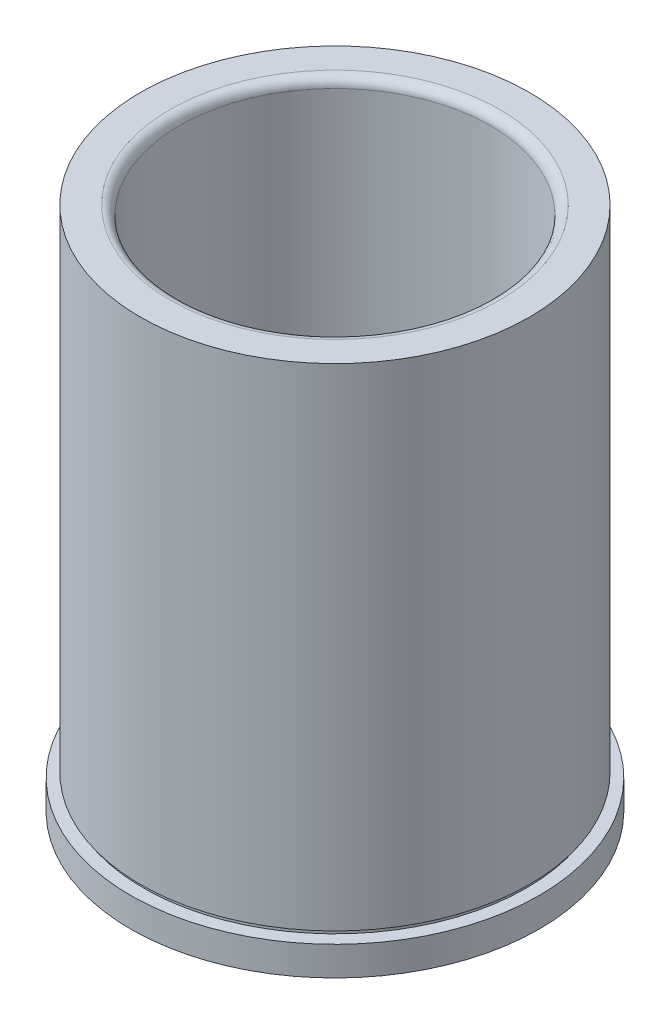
ISO-10303-21;
HEADER;
FILE_DESCRIPTION(('STEP AP214'),'2;1');
FILE_NAME('part.step','',(''),(''),'','','');
FILE_SCHEMA(('AUTOMOTIVE_DESIGN { 1 0 10303 214 1 1 1 1 }'));
ENDSEC;
DATA;
#1=APPLICATION_CONTEXT('core data for automotive mechanical design processes');
#2=APPLICATION_PROTOCOL_DEFINITION('international standard','automotive_design',2000,#1);
#3=PRODUCT_CONTEXT('',#1,'mechanical');
#4=PRODUCT('Part','Part','',(#3));
#5=PRODUCT_RELATED_PRODUCT_CATEGORY('part','',(#4));
#6=PRODUCT_DEFINITION_FORMATION('','',#4);
#7=PRODUCT_DEFINITION_CONTEXT('part definition',#1,'design');
#8=PRODUCT_DEFINITION('design','',#6,#7);
#9=PRODUCT_DEFINITION_SHAPE('','',#8);
#10=(LENGTH_UNIT() NAMED_UNIT(*) SI_UNIT(.MILLI.,.METRE.));
#11=(NAMED_UNIT(*) PLANE_ANGLE_UNIT() SI_UNIT($,.RADIAN.));
#12=(NAMED_UNIT(*) SI_UNIT($,.STERADIAN.) SOLID_ANGLE_UNIT());
#13=UNCERTAINTY_MEASURE_WITH_UNIT(LENGTH_MEASURE(1.E-05),#10,'distance_accuracy_value','');
#14=(GEOMETRIC_REPRESENTATION_CONTEXT(3) GLOBAL_UNCERTAINTY_ASSIGNED_CONTEXT((#13)) GLOBAL_UNIT_ASSIGNED_CONTEXT((#10,
#11,#12)) REPRESENTATION_CONTEXT('',''));
#15=CARTESIAN_POINT('',(0.,0.,0.));
#16=DIRECTION('',(0.,0.,1.));
#17=DIRECTION('',(1.,0.,0.));
#18=AXIS2_PLACEMENT_3D('',#15,#16,#17);
#19=CARTESIAN_POINT('',(-31.75635,101.650690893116,0.));
#20=DIRECTION('',(0.,-1.,0.));
#21=DIRECTION('',(1.,0.,0.));
#22=AXIS2_PLACEMENT_3D('',#19,#20,#21);
#23=PLANE('',#22);
#24=CARTESIAN_POINT('',(-3.54911695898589E-13,101.650690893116,0.));
#25=DIRECTION('',(0.,-1.,0.));
#26=DIRECTION('',(1.,0.,0.));
#27=AXIS2_PLACEMENT_3D('',#24,#25,#26);
#28=CIRCLE('',#27,26.9303499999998);
#29=CARTESIAN_POINT('',(26.9303499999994,101.650690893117,0.));
#30=VERTEX_POINT('',#29);
#31=EDGE_CURVE('E35',#30,#30,#28,.T.);
#32=ORIENTED_EDGE('',*,*,#31,.T.);
#33=EDGE_LOOP('',(#32));
#34=FACE_BOUND('',#33,.T.);
#35=CARTESIAN_POINT('',(-3.54911695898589E-13,101.650690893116,0.));
#36=DIRECTION('',(0.,-1.,0.));
#37=DIRECTION('',(1.,0.,0.));
#38=AXIS2_PLACEMENT_3D('',#35,#36,#37);
#39=CIRCLE('',#38,31.7563499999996);
#40=CARTESIAN_POINT('',(31.7563499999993,101.650690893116,0.));
#41=VERTEX_POINT('',#40);
#42=EDGE_CURVE('E63',#41,#41,#39,.T.);
#43=ORIENTED_EDGE('',*,*,#42,.F.);
#44=EDGE_LOOP('',(#43));
#45=FACE_BOUND('',#44,.T.);
#46=ADVANCED_FACE('F28',(#34,#45),#23,.F.);
#47=CARTESIAN_POINT('',(3.49148336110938E-12,-1000.,0.));
#48=DIRECTION('',(0.,-1.,0.));
#49=DIRECTION('',(1.,0.,0.));
#50=AXIS2_PLACEMENT_3D('',#47,#48,#49);
#51=CYLINDRICAL_SURFACE('',#50,25.4063499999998);
#52=CARTESIAN_POINT('',(-3.49590675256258E-13,100.126690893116,0.));
#53=DIRECTION('',(0.,-1.,0.));
#54=DIRECTION('',(1.,0.,0.));
#55=AXIS2_PLACEMENT_3D('',#52,#53,#54);
#56=CIRCLE('',#55,25.4063499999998);
#57=CARTESIAN_POINT('',(25.4063499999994,100.126690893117,0.));
#58=VERTEX_POINT('',#57);
#59=EDGE_CURVE('E10',#58,#58,#56,.F.);
#60=ORIENTED_EDGE('',*,*,#59,.T.);
#61=EDGE_LOOP('',(#60));
#62=FACE_BOUND('',#61,.T.);
#63=CARTESIAN_POINT('',(0.,16.7417464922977,0.));
#64=DIRECTION('',(0.,-1.,0.));
#65=DIRECTION('',(1.,0.,0.));
#66=AXIS2_PLACEMENT_3D('',#63,#64,#65);
#67=CIRCLE('',#66,25.4063499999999);
#68=CARTESIAN_POINT('',(25.4063499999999,16.7417464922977,0.));
#69=VERTEX_POINT('',#68);
#70=EDGE_CURVE('E39',#69,#69,#67,.T.);
#71=ORIENTED_EDGE('',*,*,#70,.T.);
#72=EDGE_LOOP('',(#71));
#73=FACE_BOUND('',#72,.T.);
#74=ADVANCED_FACE('F70',(#62,#73),#51,.F.);
#75=CARTESIAN_POINT('',(0.,15.9256908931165,0.));
#76=DIRECTION('',(0.,-1.,0.));
#77=DIRECTION('',(1.,0.,0.));
#78=AXIS2_PLACEMENT_3D('',#75,#76,#77);
#79=CONICAL_SURFACE('',#78,26.2224055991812,0.78539816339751);
#80=ORIENTED_EDGE('',*,*,#70,.F.);
#81=EDGE_LOOP('',(#80));
#82=FACE_BOUND('',#81,.T.);
#83=CARTESIAN_POINT('',(0.,15.9256908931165,0.));
#84=DIRECTION('',(0.,-1.,0.));
#85=DIRECTION('',(1.,0.,0.));
#86=AXIS2_PLACEMENT_3D('',#83,#84,#85);
#87=CIRCLE('',#86,26.2224055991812);
#88=CARTESIAN_POINT('',(26.2224055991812,15.9256908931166,0.));
#89=VERTEX_POINT('',#88);
#90=EDGE_CURVE('E43',#89,#89,#87,.T.);
#91=ORIENTED_EDGE('',*,*,#90,.T.);
#92=EDGE_LOOP('',(#91));
#93=FACE_BOUND('',#92,.T.);
#94=ADVANCED_FACE('F74',(#82,#93),#79,.F.);
#95=CARTESIAN_POINT('',(-26.2224055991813,15.9256908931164,0.));
#96=DIRECTION('',(0.,1.,0.));
#97=DIRECTION('',(-1.,0.,0.));
#98=AXIS2_PLACEMENT_3D('',#95,#96,#97);
#99=PLANE('',#98);
#100=ORIENTED_EDGE('',*,*,#90,.F.);
#101=EDGE_LOOP('',(#100));
#102=FACE_BOUND('',#101,.T.);
#103=CARTESIAN_POINT('',(0.,15.9256908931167,0.));
#104=DIRECTION('',(0.,-1.,0.));
#105=DIRECTION('',(1.,0.,0.));
#106=AXIS2_PLACEMENT_3D('',#103,#104,#105);
#107=CIRCLE('',#106,33.3374999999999);
#108=CARTESIAN_POINT('',(33.3374999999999,15.9256908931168,0.));
#109=VERTEX_POINT('',#108);
#110=EDGE_CURVE('E48',#109,#109,#107,.T.);
#111=ORIENTED_EDGE('',*,*,#110,.T.);
#112=EDGE_LOOP('',(#111));
#113=FACE_BOUND('',#112,.T.);
#114=ADVANCED_FACE('F79',(#102,#113),#99,.F.);
#115=CARTESIAN_POINT('',(3.49148336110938E-12,-1000.,0.));
#116=DIRECTION('',(0.,-1.,0.));
#117=DIRECTION('',(1.,0.,0.));
#118=AXIS2_PLACEMENT_3D('',#115,#116,#117);
#119=CYLINDRICAL_SURFACE('',#118,33.3374999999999);
#120=ORIENTED_EDGE('',*,*,#110,.F.);
#121=EDGE_LOOP('',(#120));
#122=FACE_BOUND('',#121,.T.);
#123=CARTESIAN_POINT('',(0.,20.6881908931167,0.));
#124=DIRECTION('',(0.,-1.,0.));
#125=DIRECTION('',(1.,0.,0.));
#126=AXIS2_PLACEMENT_3D('',#123,#124,#125);
#127=CIRCLE('',#126,33.3374999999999);
#128=CARTESIAN_POINT('',(33.3374999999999,20.6881908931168,0.));
#129=VERTEX_POINT('',#128);
#130=EDGE_CURVE('E51',#129,#129,#127,.T.);
#131=ORIENTED_EDGE('',*,*,#130,.T.);
#132=EDGE_LOOP('',(#131));
#133=FACE_BOUND('',#132,.T.);
#134=ADVANCED_FACE('F83',(#122,#133),#119,.T.);
#135=CARTESIAN_POINT('',(-33.3375,20.6881908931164,0.));
#136=DIRECTION('',(0.,-1.,0.));
#137=DIRECTION('',(1.,0.,0.));
#138=AXIS2_PLACEMENT_3D('',#135,#136,#137);
#139=PLANE('',#138);
#140=ORIENTED_EDGE('',*,*,#130,.F.);
#141=EDGE_LOOP('',(#140));
#142=FACE_BOUND('',#141,.T.);
#143=CARTESIAN_POINT('',(0.,20.6881908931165,0.));
#144=DIRECTION('',(0.,-1.,0.));
#145=DIRECTION('',(1.,0.,0.));
#146=AXIS2_PLACEMENT_3D('',#143,#144,#145);
#147=CIRCLE('',#146,31.2483499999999);
#148=CARTESIAN_POINT('',(31.2483499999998,20.6881908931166,0.));
#149=VERTEX_POINT('',#148);
#150=EDGE_CURVE('E54',#149,#149,#147,.T.);
#151=ORIENTED_EDGE('',*,*,#150,.T.);
#152=EDGE_LOOP('',(#151));
#153=FACE_BOUND('',#152,.T.);
#154=ADVANCED_FACE('F87',(#142,#153),#139,.F.);
#155=CARTESIAN_POINT('',(3.49148336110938E-12,-1000.,0.));
#156=DIRECTION('',(0.,-1.,0.));
#157=DIRECTION('',(1.,0.,0.));
#158=AXIS2_PLACEMENT_3D('',#155,#156,#157);
#159=CYLINDRICAL_SURFACE('',#158,31.2483499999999);
#160=ORIENTED_EDGE('',*,*,#150,.F.);
#161=EDGE_LOOP('',(#160));
#162=FACE_BOUND('',#161,.T.);
#163=CARTESIAN_POINT('',(0.,21.4501908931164,0.));
#164=DIRECTION('',(0.,-1.,0.));
#165=DIRECTION('',(1.,0.,0.));
#166=AXIS2_PLACEMENT_3D('',#163,#164,#165);
#167=CIRCLE('',#166,31.2483499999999);
#168=CARTESIAN_POINT('',(31.2483499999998,21.4501908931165,0.));
#169=VERTEX_POINT('',#168);
#170=EDGE_CURVE('E57',#169,#169,#167,.T.);
#171=ORIENTED_EDGE('',*,*,#170,.T.);
#172=EDGE_LOOP('',(#171));
#173=FACE_BOUND('',#172,.T.);
#174=ADVANCED_FACE('F91',(#162,#173),#159,.T.);
#175=CARTESIAN_POINT('',(-31.75635,21.4501908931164,0.));
#176=DIRECTION('',(0.,1.,0.));
#177=DIRECTION('',(-1.,0.,0.));
#178=AXIS2_PLACEMENT_3D('',#175,#176,#177);
#179=PLANE('',#178);
#180=ORIENTED_EDGE('',*,*,#170,.F.);
#181=EDGE_LOOP('',(#180));
#182=FACE_BOUND('',#181,.T.);
#183=CARTESIAN_POINT('',(0.,21.4501908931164,0.));
#184=DIRECTION('',(0.,-1.,0.));
#185=DIRECTION('',(1.,0.,0.));
#186=AXIS2_PLACEMENT_3D('',#183,#184,#185);
#187=CIRCLE('',#186,31.7563499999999);
#188=CARTESIAN_POINT('',(31.7563499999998,21.4501908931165,0.));
#189=VERTEX_POINT('',#188);
#190=EDGE_CURVE('E60',#189,#189,#187,.T.);
#191=ORIENTED_EDGE('',*,*,#190,.T.);
#192=EDGE_LOOP('',(#191));
#193=FACE_BOUND('',#192,.T.);
#194=ADVANCED_FACE('F95',(#182,#193),#179,.F.);
#195=CARTESIAN_POINT('',(3.49148336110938E-12,-1000.,0.));
#196=DIRECTION('',(0.,-1.,0.));
#197=DIRECTION('',(1.,0.,0.));
#198=AXIS2_PLACEMENT_3D('',#195,#196,#197);
#199=CYLINDRICAL_SURFACE('',#198,31.7563499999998);
#200=ORIENTED_EDGE('',*,*,#190,.F.);
#201=EDGE_LOOP('',(#200));
#202=FACE_BOUND('',#201,.T.);
#203=ORIENTED_EDGE('',*,*,#42,.T.);
#204=EDGE_LOOP('',(#203));
#205=FACE_BOUND('',#204,.T.);
#206=ADVANCED_FACE('F67',(#202,#205),#199,.T.);
#207=CARTESIAN_POINT('',(-3.49590675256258E-13,100.126690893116,0.));
#208=DIRECTION('',(0.,-1.,0.));
#209=DIRECTION('',(1.,0.,0.));
#210=AXIS2_PLACEMENT_3D('',#207,#208,#209);
#211=TOROIDAL_SURFACE('',#210,26.9303499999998,1.524);
#212=ORIENTED_EDGE('',*,*,#59,.F.);
#213=EDGE_LOOP('',(#212));
#214=FACE_BOUND('',#213,.T.);
#215=ORIENTED_EDGE('',*,*,#31,.F.);
#216=EDGE_LOOP('',(#215));
#217=FACE_BOUND('',#216,.T.);
#218=ADVANCED_FACE('F30',(#214,#217),#211,.T.);
#219=CLOSED_SHELL('',(#46,#74,#94,#114,#134,#154,#174,#194,#206,#218));
#220=MANIFOLD_SOLID_BREP('B2',#219);
#221=ADVANCED_BREP_SHAPE_REPRESENTATION('',(#18,#220),#14);
#222=SHAPE_DEFINITION_REPRESENTATION(#9,#221);
ENDSEC;
END-ISO-10303-21;
